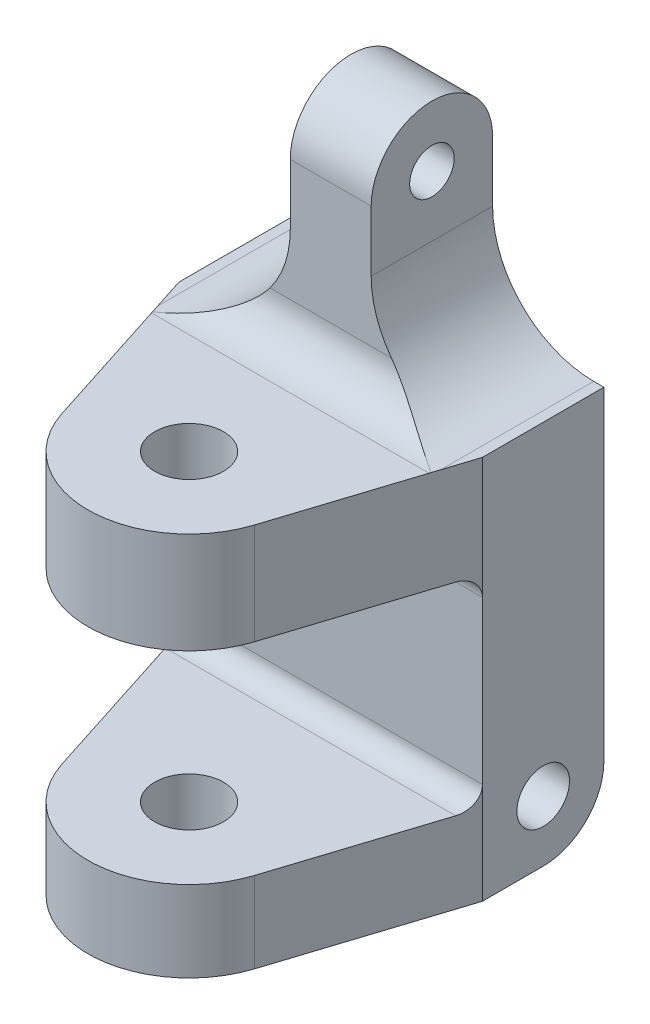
ISO-10303-21;
HEADER;
FILE_DESCRIPTION(('STEP AP214'),'2;1');
FILE_NAME('part.step','',(''),(''),'','','');
FILE_SCHEMA(('AUTOMOTIVE_DESIGN { 1 0 10303 214 1 1 1 1 }'));
ENDSEC;
DATA;
#1=APPLICATION_CONTEXT('core data for automotive mechanical design processes');
#2=APPLICATION_PROTOCOL_DEFINITION('international standard','automotive_design',2000,#1);
#3=PRODUCT_CONTEXT('',#1,'mechanical');
#4=PRODUCT('Part','Part','',(#3));
#5=PRODUCT_RELATED_PRODUCT_CATEGORY('part','',(#4));
#6=PRODUCT_DEFINITION_FORMATION('','',#4);
#7=PRODUCT_DEFINITION_CONTEXT('part definition',#1,'design');
#8=PRODUCT_DEFINITION('design','',#6,#7);
#9=PRODUCT_DEFINITION_SHAPE('','',#8);
#10=(LENGTH_UNIT() NAMED_UNIT(*) SI_UNIT(.MILLI.,.METRE.));
#11=(NAMED_UNIT(*) PLANE_ANGLE_UNIT() SI_UNIT($,.RADIAN.));
#12=(NAMED_UNIT(*) SI_UNIT($,.STERADIAN.) SOLID_ANGLE_UNIT());
#13=UNCERTAINTY_MEASURE_WITH_UNIT(LENGTH_MEASURE(1.E-05),#10,'distance_accuracy_value','');
#14=(GEOMETRIC_REPRESENTATION_CONTEXT(3) GLOBAL_UNCERTAINTY_ASSIGNED_CONTEXT((#13)) GLOBAL_UNIT_ASSIGNED_CONTEXT((#10,
#11,#12)) REPRESENTATION_CONTEXT('',''));
#15=CARTESIAN_POINT('',(0.,0.,0.));
#16=DIRECTION('',(0.,0.,1.));
#17=DIRECTION('',(1.,0.,0.));
#18=AXIS2_PLACEMENT_3D('',#15,#16,#17);
#19=CARTESIAN_POINT('',(9.525,-19.05,3.81000000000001));
#20=DIRECTION('',(0.952091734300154,0.,0.305812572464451));
#21=DIRECTION('',(0.305812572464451,0.,-0.952091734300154));
#22=AXIS2_PLACEMENT_3D('',#19,#20,#21);
#23=PLANE('',#22);
#24=DIRECTION('',(0.305812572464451,0.,-0.952091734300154));
#25=VECTOR('',#24,1.);
#26=CARTESIAN_POINT('',(9.525,5.08,3.81));
#27=LINE('',#26,#25);
#28=CARTESIAN_POINT('',(8.89,5.08,5.78695682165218));
#29=VERTEX_POINT('',#28);
#30=CARTESIAN_POINT('',(9.525,5.08,3.81000000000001));
#31=VERTEX_POINT('',#30);
#32=EDGE_CURVE('E243',#29,#31,#27,.T.);
#33=ORIENTED_EDGE('',*,*,#32,.F.);
#34=CARTESIAN_POINT('',(8.89,11.43,5.78695682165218));
#35=DIRECTION('',(0.952091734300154,0.,0.305812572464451));
#36=DIRECTION('',(-0.305812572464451,0.,0.952091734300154));
#37=AXIS2_PLACEMENT_3D('',#34,#35,#36);
#38=ELLIPSE('',#37,20.7643523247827,6.35);
#39=CARTESIAN_POINT('',(8.73968306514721,5.08177939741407,6.25494121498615));
#40=VERTEX_POINT('',#39);
#41=EDGE_CURVE('E236',#40,#29,#38,.T.);
#42=ORIENTED_EDGE('',*,*,#41,.F.);
#43=CARTESIAN_POINT('',(8.70915011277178,7.62,6.35000000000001));
#44=DIRECTION('',(0.952091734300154,0.,0.305812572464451));
#45=DIRECTION('',(0.305812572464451,0.,-0.952091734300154));
#46=AXIS2_PLACEMENT_3D('',#43,#44,#45);
#47=ELLIPSE('',#46,2.66781015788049,2.54);
#48=CARTESIAN_POINT('',(8.70915011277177,5.08,6.35000000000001));
#49=VERTEX_POINT('',#48);
#50=EDGE_CURVE('E289',#49,#40,#47,.T.);
#51=ORIENTED_EDGE('',*,*,#50,.F.);
#52=DIRECTION('',(0.305812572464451,0.,-0.952091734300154));
#53=VECTOR('',#52,1.);
#54=CARTESIAN_POINT('',(9.525,5.08,3.81000000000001));
#55=LINE('',#54,#53);
#56=CARTESIAN_POINT('',(6.04578251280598,5.08,14.6419098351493));
#57=VERTEX_POINT('',#56);
#58=EDGE_CURVE('E287',#57,#49,#55,.T.);
#59=ORIENTED_EDGE('',*,*,#58,.F.);
#60=DIRECTION('',(0.,1.,0.));
#61=VECTOR('',#60,1.);
#62=CARTESIAN_POINT('',(6.04578251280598,-19.05,14.6419098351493));
#63=LINE('',#62,#61);
#64=CARTESIAN_POINT('',(6.04578251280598,-1.27,14.6419098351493));
#65=VERTEX_POINT('',#64);
#66=EDGE_CURVE('E325',#65,#57,#63,.T.);
#67=ORIENTED_EDGE('',*,*,#66,.F.);
#68=DIRECTION('',(-0.305812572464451,0.,0.952091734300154));
#69=VECTOR('',#68,1.);
#70=CARTESIAN_POINT('',(9.525,-1.27,3.81000000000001));
#71=LINE('',#70,#69);
#72=CARTESIAN_POINT('',(9.11707505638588,-1.27,5.08));
#73=VERTEX_POINT('',#72);
#74=EDGE_CURVE('E302',#73,#65,#71,.T.);
#75=ORIENTED_EDGE('',*,*,#74,.F.);
#76=CARTESIAN_POINT('',(9.11707505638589,-2.54,5.08));
#77=DIRECTION('',(0.952091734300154,0.,0.305812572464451));
#78=DIRECTION('',(0.305812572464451,0.,-0.952091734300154));
#79=AXIS2_PLACEMENT_3D('',#76,#77,#78);
#80=ELLIPSE('',#79,1.33390507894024,1.27);
#81=CARTESIAN_POINT('',(9.525,-2.54,3.81000000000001));
#82=VERTEX_POINT('',#81);
#83=EDGE_CURVE('E298',#82,#73,#80,.T.);
#84=ORIENTED_EDGE('',*,*,#83,.F.);
#85=DIRECTION('',(0.,-1.,0.));
#86=VECTOR('',#85,1.);
#87=CARTESIAN_POINT('',(9.525,15.24,3.81000000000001));
#88=LINE('',#87,#86);
#89=EDGE_CURVE('E329',#31,#82,#88,.T.);
#90=ORIENTED_EDGE('',*,*,#89,.F.);
#91=EDGE_LOOP('',(#33,#42,#51,#59,#67,#75,#84,#90));
#92=FACE_BOUND('',#91,.T.);
#93=ADVANCED_FACE('F33',(#92),#23,.T.);
#94=CARTESIAN_POINT('',(0.,-19.05,12.7));
#95=DIRECTION('',(0.,1.,0.));
#96=DIRECTION('',(0.,0.,1.));
#97=AXIS2_PLACEMENT_3D('',#94,#95,#96);
#98=CYLINDRICAL_SURFACE('',#97,6.35);
#99=CARTESIAN_POINT('',(0.,-1.27,12.7));
#100=DIRECTION('',(0.,1.,0.));
#101=DIRECTION('',(0.,0.,1.));
#102=AXIS2_PLACEMENT_3D('',#99,#100,#101);
#103=CIRCLE('',#102,6.35);
#104=CARTESIAN_POINT('',(-6.04578251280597,-1.27,14.6419098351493));
#105=VERTEX_POINT('',#104);
#106=EDGE_CURVE('E300',#65,#105,#103,.F.);
#107=ORIENTED_EDGE('',*,*,#106,.F.);
#108=ORIENTED_EDGE('',*,*,#66,.T.);
#109=CARTESIAN_POINT('',(0.,5.08,12.7));
#110=DIRECTION('',(0.,-1.,0.));
#111=DIRECTION('',(0.,0.,-1.));
#112=AXIS2_PLACEMENT_3D('',#109,#110,#111);
#113=CIRCLE('',#112,6.35);
#114=CARTESIAN_POINT('',(-6.04578251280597,5.08,14.6419098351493));
#115=VERTEX_POINT('',#114);
#116=EDGE_CURVE('E273',#115,#57,#113,.F.);
#117=ORIENTED_EDGE('',*,*,#116,.F.);
#118=DIRECTION('',(0.,1.,0.));
#119=VECTOR('',#118,1.);
#120=CARTESIAN_POINT('',(-6.04578251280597,-19.05,14.6419098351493));
#121=LINE('',#120,#119);
#122=EDGE_CURVE('E320',#105,#115,#121,.T.);
#123=ORIENTED_EDGE('',*,*,#122,.F.);
#124=EDGE_LOOP('',(#107,#108,#117,#123));
#125=FACE_BOUND('',#124,.T.);
#126=ADVANCED_FACE('F413',(#125),#98,.T.);
#127=CARTESIAN_POINT('',(-9.525,-19.05,3.81000000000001));
#128=DIRECTION('',(-0.952091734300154,0.,0.305812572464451));
#129=DIRECTION('',(0.305812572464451,0.,0.952091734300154));
#130=AXIS2_PLACEMENT_3D('',#127,#128,#129);
#131=PLANE('',#130);
#132=CARTESIAN_POINT('',(-8.89,11.43,5.78695682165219));
#133=DIRECTION('',(-0.952091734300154,0.,0.305812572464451));
#134=DIRECTION('',(0.305812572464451,0.,0.952091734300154));
#135=AXIS2_PLACEMENT_3D('',#132,#133,#134);
#136=ELLIPSE('',#135,20.7643523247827,6.35);
#137=CARTESIAN_POINT('',(-8.89,5.08,5.78695682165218));
#138=VERTEX_POINT('',#137);
#139=CARTESIAN_POINT('',(-8.73968306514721,5.08177939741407,6.25494121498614));
#140=VERTEX_POINT('',#139);
#141=EDGE_CURVE('E48',#138,#140,#136,.T.);
#142=ORIENTED_EDGE('',*,*,#141,.F.);
#143=DIRECTION('',(0.305812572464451,0.,0.952091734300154));
#144=VECTOR('',#143,1.);
#145=CARTESIAN_POINT('',(-9.525,5.08,3.81));
#146=LINE('',#145,#144);
#147=CARTESIAN_POINT('',(-9.525,5.08,3.81000000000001));
#148=VERTEX_POINT('',#147);
#149=EDGE_CURVE('E188',#148,#138,#146,.T.);
#150=ORIENTED_EDGE('',*,*,#149,.F.);
#151=DIRECTION('',(0.,-1.,0.));
#152=VECTOR('',#151,1.);
#153=CARTESIAN_POINT('',(-9.525,15.24,3.81000000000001));
#154=LINE('',#153,#152);
#155=CARTESIAN_POINT('',(-9.525,-2.53999999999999,3.81));
#156=VERTEX_POINT('',#155);
#157=EDGE_CURVE('E338',#148,#156,#154,.T.);
#158=ORIENTED_EDGE('',*,*,#157,.T.);
#159=CARTESIAN_POINT('',(-9.11707505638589,-2.54,5.08));
#160=DIRECTION('',(-0.952091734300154,0.,0.305812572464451));
#161=DIRECTION('',(0.305812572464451,0.,0.952091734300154));
#162=AXIS2_PLACEMENT_3D('',#159,#160,#161);
#163=ELLIPSE('',#162,1.33390507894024,1.27);
#164=CARTESIAN_POINT('',(-9.11707505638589,-1.27,5.08));
#165=VERTEX_POINT('',#164);
#166=EDGE_CURVE('E358',#165,#156,#163,.T.);
#167=ORIENTED_EDGE('',*,*,#166,.F.);
#168=DIRECTION('',(-0.305812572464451,0.,-0.952091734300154));
#169=VECTOR('',#168,1.);
#170=CARTESIAN_POINT('',(-9.525,-1.27,3.81000000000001));
#171=LINE('',#170,#169);
#172=EDGE_CURVE('E361',#105,#165,#171,.T.);
#173=ORIENTED_EDGE('',*,*,#172,.F.);
#174=ORIENTED_EDGE('',*,*,#122,.T.);
#175=DIRECTION('',(0.305812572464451,0.,0.952091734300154));
#176=VECTOR('',#175,1.);
#177=CARTESIAN_POINT('',(-9.525,5.08,3.81000000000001));
#178=LINE('',#177,#176);
#179=CARTESIAN_POINT('',(-8.70915011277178,5.08,6.35000000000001));
#180=VERTEX_POINT('',#179);
#181=EDGE_CURVE('E350',#180,#115,#178,.T.);
#182=ORIENTED_EDGE('',*,*,#181,.F.);
#183=CARTESIAN_POINT('',(-8.70915011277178,7.62,6.35000000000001));
#184=DIRECTION('',(-0.952091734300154,0.,0.305812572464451));
#185=DIRECTION('',(0.305812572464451,0.,0.952091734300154));
#186=AXIS2_PLACEMENT_3D('',#183,#184,#185);
#187=ELLIPSE('',#186,2.66781015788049,2.54);
#188=EDGE_CURVE('E352',#140,#180,#187,.T.);
#189=ORIENTED_EDGE('',*,*,#188,.F.);
#190=EDGE_LOOP('',(#142,#150,#158,#167,#173,#174,#182,#189));
#191=FACE_BOUND('',#190,.T.);
#192=ADVANCED_FACE('F417',(#191),#131,.T.);
#193=CARTESIAN_POINT('',(9.525,15.24,0.));
#194=DIRECTION('',(-1.,0.,0.));
#195=DIRECTION('',(0.,0.,1.));
#196=AXIS2_PLACEMENT_3D('',#193,#194,#195);
#197=CYLINDRICAL_SURFACE('',#196,3.81);
#198=CARTESIAN_POINT('',(-2.54,15.24,0.));
#199=DIRECTION('',(1.,0.,0.));
#200=DIRECTION('',(0.,1.,0.));
#201=AXIS2_PLACEMENT_3D('',#198,#199,#200);
#202=CIRCLE('',#201,3.81);
#203=CARTESIAN_POINT('',(-2.54,15.24,-3.81));
#204=VERTEX_POINT('',#203);
#205=CARTESIAN_POINT('',(-2.54,15.24,3.81000000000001));
#206=VERTEX_POINT('',#205);
#207=EDGE_CURVE('E233',#204,#206,#202,.T.);
#208=ORIENTED_EDGE('',*,*,#207,.T.);
#209=DIRECTION('',(-1.,0.,0.));
#210=VECTOR('',#209,1.);
#211=CARTESIAN_POINT('',(9.525,15.24,3.81000000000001));
#212=LINE('',#211,#210);
#213=CARTESIAN_POINT('',(2.54000000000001,15.24,3.81000000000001));
#214=VERTEX_POINT('',#213);
#215=EDGE_CURVE('E347',#214,#206,#212,.T.);
#216=ORIENTED_EDGE('',*,*,#215,.F.);
#217=CARTESIAN_POINT('',(2.54000000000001,15.24,0.));
#218=DIRECTION('',(-1.,0.,0.));
#219=DIRECTION('',(0.,-1.,0.));
#220=AXIS2_PLACEMENT_3D('',#217,#218,#219);
#221=CIRCLE('',#220,3.81);
#222=CARTESIAN_POINT('',(2.54000000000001,15.24,-3.81));
#223=VERTEX_POINT('',#222);
#224=EDGE_CURVE('E227',#214,#223,#221,.T.);
#225=ORIENTED_EDGE('',*,*,#224,.T.);
#226=DIRECTION('',(-1.,0.,0.));
#227=VECTOR('',#226,1.);
#228=CARTESIAN_POINT('',(9.525,15.24,-3.80999999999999));
#229=LINE('',#228,#227);
#230=EDGE_CURVE('E337',#223,#204,#229,.T.);
#231=ORIENTED_EDGE('',*,*,#230,.T.);
#232=EDGE_LOOP('',(#208,#216,#225,#231));
#233=FACE_BOUND('',#232,.T.);
#234=ADVANCED_FACE('F35',(#233),#197,.T.);
#235=CARTESIAN_POINT('',(9.525,-15.24,0.));
#236=DIRECTION('',(-1.,0.,0.));
#237=DIRECTION('',(0.,0.,1.));
#238=AXIS2_PLACEMENT_3D('',#235,#236,#237);
#239=CYLINDRICAL_SURFACE('',#238,3.81);
#240=CARTESIAN_POINT('',(9.525,-15.24,0.));
#241=DIRECTION('',(1.,0.,0.));
#242=DIRECTION('',(0.,0.,-1.));
#243=AXIS2_PLACEMENT_3D('',#240,#241,#242);
#244=CIRCLE('',#243,3.81);
#245=CARTESIAN_POINT('',(9.525,-19.05,0.));
#246=VERTEX_POINT('',#245);
#247=CARTESIAN_POINT('',(9.525,-15.24,-3.81));
#248=VERTEX_POINT('',#247);
#249=EDGE_CURVE('E331',#246,#248,#244,.T.);
#250=ORIENTED_EDGE('',*,*,#249,.F.);
#251=DIRECTION('',(-1.,0.,0.));
#252=VECTOR('',#251,1.);
#253=CARTESIAN_POINT('',(-9.525,-19.05,0.));
#254=LINE('',#253,#252);
#255=CARTESIAN_POINT('',(-9.525,-19.05,0.));
#256=VERTEX_POINT('',#255);
#257=EDGE_CURVE('E307',#246,#256,#254,.T.);
#258=ORIENTED_EDGE('',*,*,#257,.T.);
#259=CARTESIAN_POINT('',(-9.525,-15.24,0.));
#260=DIRECTION('',(1.,0.,0.));
#261=DIRECTION('',(0.,0.,-1.));
#262=AXIS2_PLACEMENT_3D('',#259,#260,#261);
#263=CIRCLE('',#262,3.81);
#264=CARTESIAN_POINT('',(-9.525,-15.24,-3.81));
#265=VERTEX_POINT('',#264);
#266=EDGE_CURVE('E340',#256,#265,#263,.T.);
#267=ORIENTED_EDGE('',*,*,#266,.T.);
#268=DIRECTION('',(-1.,0.,0.));
#269=VECTOR('',#268,1.);
#270=CARTESIAN_POINT('',(9.525,-15.24,-3.81));
#271=LINE('',#270,#269);
#272=EDGE_CURVE('E345',#248,#265,#271,.T.);
#273=ORIENTED_EDGE('',*,*,#272,.F.);
#274=EDGE_LOOP('',(#250,#258,#267,#273));
#275=FACE_BOUND('',#274,.T.);
#276=ADVANCED_FACE('F426',(#275),#239,.T.);
#277=CARTESIAN_POINT('',(9.525,15.24,-3.80999999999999));
#278=DIRECTION('',(0.,0.,1.));
#279=DIRECTION('',(0.,-1.,0.));
#280=AXIS2_PLACEMENT_3D('',#277,#278,#279);
#281=PLANE('',#280);
#282=CARTESIAN_POINT('',(-8.89,11.43,-3.81));
#283=DIRECTION('',(0.,0.,1.));
#284=DIRECTION('',(-1.,0.,0.));
#285=AXIS2_PLACEMENT_3D('',#282,#283,#284);
#286=CIRCLE('',#285,6.35);
#287=CARTESIAN_POINT('',(-8.89,5.08,-3.81));
#288=VERTEX_POINT('',#287);
#289=CARTESIAN_POINT('',(-2.54,11.43,-3.81));
#290=VERTEX_POINT('',#289);
#291=EDGE_CURVE('E193',#288,#290,#286,.T.);
#292=ORIENTED_EDGE('',*,*,#291,.T.);
#293=DIRECTION('',(0.,1.,0.));
#294=VECTOR('',#293,1.);
#295=CARTESIAN_POINT('',(-2.54,19.05,-3.81));
#296=LINE('',#295,#294);
#297=EDGE_CURVE('E190',#290,#204,#296,.T.);
#298=ORIENTED_EDGE('',*,*,#297,.T.);
#299=ORIENTED_EDGE('',*,*,#230,.F.);
#300=DIRECTION('',(0.,-1.,0.));
#301=VECTOR('',#300,1.);
#302=CARTESIAN_POINT('',(2.54000000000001,19.05,-3.81));
#303=LINE('',#302,#301);
#304=CARTESIAN_POINT('',(2.54000000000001,11.43,-3.81));
#305=VERTEX_POINT('',#304);
#306=EDGE_CURVE('E214',#223,#305,#303,.T.);
#307=ORIENTED_EDGE('',*,*,#306,.T.);
#308=CARTESIAN_POINT('',(8.89,11.43,-3.81));
#309=DIRECTION('',(0.,0.,1.));
#310=DIRECTION('',(1.,0.,0.));
#311=AXIS2_PLACEMENT_3D('',#308,#309,#310);
#312=CIRCLE('',#311,6.35);
#313=CARTESIAN_POINT('',(8.89,5.08,-3.81));
#314=VERTEX_POINT('',#313);
#315=EDGE_CURVE('E217',#305,#314,#312,.T.);
#316=ORIENTED_EDGE('',*,*,#315,.T.);
#317=DIRECTION('',(1.,0.,0.));
#318=VECTOR('',#317,1.);
#319=CARTESIAN_POINT('',(8.89,5.08,-3.81));
#320=LINE('',#319,#318);
#321=CARTESIAN_POINT('',(9.525,5.08,-3.81));
#322=VERTEX_POINT('',#321);
#323=EDGE_CURVE('E220',#314,#322,#320,.T.);
#324=ORIENTED_EDGE('',*,*,#323,.T.);
#325=DIRECTION('',(0.,1.,0.));
#326=VECTOR('',#325,1.);
#327=CARTESIAN_POINT('',(9.525,15.24,-3.80999999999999));
#328=LINE('',#327,#326);
#329=EDGE_CURVE('E334',#248,#322,#328,.T.);
#330=ORIENTED_EDGE('',*,*,#329,.F.);
#331=ORIENTED_EDGE('',*,*,#272,.T.);
#332=DIRECTION('',(0.,1.,0.));
#333=VECTOR('',#332,1.);
#334=CARTESIAN_POINT('',(-9.525,15.24,-3.80999999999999));
#335=LINE('',#334,#333);
#336=CARTESIAN_POINT('',(-9.525,5.08,-3.81));
#337=VERTEX_POINT('',#336);
#338=EDGE_CURVE('E204',#265,#337,#335,.T.);
#339=ORIENTED_EDGE('',*,*,#338,.T.);
#340=DIRECTION('',(1.,0.,0.));
#341=VECTOR('',#340,1.);
#342=CARTESIAN_POINT('',(-8.89,5.08,-3.81));
#343=LINE('',#342,#341);
#344=EDGE_CURVE('E185',#337,#288,#343,.T.);
#345=ORIENTED_EDGE('',*,*,#344,.T.);
#346=EDGE_LOOP('',(#292,#298,#299,#307,#316,#324,#330,#331,#339,#345));
#347=FACE_BOUND('',#346,.T.);
#348=ADVANCED_FACE('F201',(#347),#281,.F.);
#349=CARTESIAN_POINT('',(9.525,15.24,0.));
#350=DIRECTION('',(1.,0.,0.));
#351=DIRECTION('',(0.,0.,-1.));
#352=AXIS2_PLACEMENT_3D('',#349,#350,#351);
#353=PLANE('',#352);
#354=DIRECTION('',(0.,0.,-1.));
#355=VECTOR('',#354,1.);
#356=CARTESIAN_POINT('',(9.525,5.08,0.));
#357=LINE('',#356,#355);
#358=EDGE_CURVE('E11',#31,#322,#357,.T.);
#359=ORIENTED_EDGE('',*,*,#358,.F.);
#360=ORIENTED_EDGE('',*,*,#89,.T.);
#361=DIRECTION('',(0.,1.,0.));
#362=VECTOR('',#361,1.);
#363=CARTESIAN_POINT('',(9.525,-12.7,3.81000000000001));
#364=LINE('',#363,#362);
#365=CARTESIAN_POINT('',(9.525,-12.7,3.81));
#366=VERTEX_POINT('',#365);
#367=EDGE_CURVE('E262',#366,#82,#364,.T.);
#368=ORIENTED_EDGE('',*,*,#367,.F.);
#369=CARTESIAN_POINT('',(9.525,-19.05,3.81000000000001));
#370=VERTEX_POINT('',#369);
#371=EDGE_CURVE('E332',#366,#370,#88,.T.);
#372=ORIENTED_EDGE('',*,*,#371,.T.);
#373=DIRECTION('',(0.,0.,-1.));
#374=VECTOR('',#373,1.);
#375=CARTESIAN_POINT('',(9.525,-19.05,0.));
#376=LINE('',#375,#374);
#377=EDGE_CURVE('E304',#370,#246,#376,.T.);
#378=ORIENTED_EDGE('',*,*,#377,.T.);
#379=ORIENTED_EDGE('',*,*,#249,.T.);
#380=ORIENTED_EDGE('',*,*,#329,.T.);
#381=EDGE_LOOP('',(#359,#360,#368,#372,#378,#379,#380));
#382=FACE_BOUND('',#381,.T.);
#383=CARTESIAN_POINT('',(9.525,-15.24,0.));
#384=DIRECTION('',(-1.,0.,0.));
#385=DIRECTION('',(0.,0.,1.));
#386=AXIS2_PLACEMENT_3D('',#383,#384,#385);
#387=CIRCLE('',#386,1.651);
#388=CARTESIAN_POINT('',(9.525,-15.24,1.651));
#389=VERTEX_POINT('',#388);
#390=EDGE_CURVE('E256',#389,#389,#387,.T.);
#391=ORIENTED_EDGE('',*,*,#390,.T.);
#392=EDGE_LOOP('',(#391));
#393=FACE_BOUND('',#392,.T.);
#394=ADVANCED_FACE('F418',(#382,#393),#353,.T.);
#395=CARTESIAN_POINT('',(-9.525,15.24,0.));
#396=DIRECTION('',(1.,0.,0.));
#397=DIRECTION('',(0.,0.,-1.));
#398=AXIS2_PLACEMENT_3D('',#395,#396,#397);
#399=PLANE('',#398);
#400=CARTESIAN_POINT('',(-9.525,-15.24,0.));
#401=DIRECTION('',(-1.,0.,0.));
#402=DIRECTION('',(0.,0.,1.));
#403=AXIS2_PLACEMENT_3D('',#400,#401,#402);
#404=CIRCLE('',#403,1.651);
#405=CARTESIAN_POINT('',(-9.525,-15.24,1.651));
#406=VERTEX_POINT('',#405);
#407=EDGE_CURVE('E255',#406,#406,#404,.T.);
#408=ORIENTED_EDGE('',*,*,#407,.F.);
#409=EDGE_LOOP('',(#408));
#410=FACE_BOUND('',#409,.T.);
#411=ORIENTED_EDGE('',*,*,#157,.F.);
#412=DIRECTION('',(0.,0.,-1.));
#413=VECTOR('',#412,1.);
#414=CARTESIAN_POINT('',(-9.525,5.08,0.));
#415=LINE('',#414,#413);
#416=EDGE_CURVE('E41',#148,#337,#415,.T.);
#417=ORIENTED_EDGE('',*,*,#416,.T.);
#418=ORIENTED_EDGE('',*,*,#338,.F.);
#419=ORIENTED_EDGE('',*,*,#266,.F.);
#420=DIRECTION('',(0.,0.,1.));
#421=VECTOR('',#420,1.);
#422=CARTESIAN_POINT('',(-9.525,-19.05,3.81000000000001));
#423=LINE('',#422,#421);
#424=CARTESIAN_POINT('',(-9.525,-19.05,3.81000000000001));
#425=VERTEX_POINT('',#424);
#426=EDGE_CURVE('E309',#256,#425,#423,.T.);
#427=ORIENTED_EDGE('',*,*,#426,.T.);
#428=CARTESIAN_POINT('',(-9.525,-12.7,3.81));
#429=VERTEX_POINT('',#428);
#430=EDGE_CURVE('E324',#429,#425,#154,.T.);
#431=ORIENTED_EDGE('',*,*,#430,.F.);
#432=DIRECTION('',(0.,1.,0.));
#433=VECTOR('',#432,1.);
#434=CARTESIAN_POINT('',(-9.525,-12.7,3.81000000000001));
#435=LINE('',#434,#433);
#436=EDGE_CURVE('E265',#429,#156,#435,.T.);
#437=ORIENTED_EDGE('',*,*,#436,.T.);
#438=EDGE_LOOP('',(#411,#417,#418,#419,#427,#431,#437));
#439=FACE_BOUND('',#438,.T.);
#440=ADVANCED_FACE('F408',(#410,#439),#399,.F.);
#441=CARTESIAN_POINT('',(9.11707505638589,-12.7,5.08));
#442=DIRECTION('',(0.952091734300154,0.,0.305812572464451));
#443=DIRECTION('',(0.305812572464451,0.,-0.952091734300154));
#444=AXIS2_PLACEMENT_3D('',#441,#442,#443);
#445=ELLIPSE('',#444,1.33390507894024,1.27);
#446=CARTESIAN_POINT('',(9.11707505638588,-13.97,5.08));
#447=VERTEX_POINT('',#446);
#448=EDGE_CURVE('E296',#447,#366,#445,.T.);
#449=ORIENTED_EDGE('',*,*,#448,.F.);
#450=DIRECTION('',(0.305812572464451,0.,-0.952091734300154));
#451=VECTOR('',#450,1.);
#452=CARTESIAN_POINT('',(9.525,-13.97,3.81));
#453=LINE('',#452,#451);
#454=CARTESIAN_POINT('',(6.04578251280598,-13.97,14.6419098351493));
#455=VERTEX_POINT('',#454);
#456=EDGE_CURVE('E294',#455,#447,#453,.T.);
#457=ORIENTED_EDGE('',*,*,#456,.F.);
#458=CARTESIAN_POINT('',(6.04578251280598,-19.05,14.6419098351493));
#459=VERTEX_POINT('',#458);
#460=EDGE_CURVE('E321',#459,#455,#63,.T.);
#461=ORIENTED_EDGE('',*,*,#460,.F.);
#462=DIRECTION('',(0.305812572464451,0.,-0.952091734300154));
#463=VECTOR('',#462,1.);
#464=CARTESIAN_POINT('',(9.525,-19.05,3.81000000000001));
#465=LINE('',#464,#463);
#466=EDGE_CURVE('E317',#459,#370,#465,.T.);
#467=ORIENTED_EDGE('',*,*,#466,.T.);
#468=ORIENTED_EDGE('',*,*,#371,.F.);
#469=EDGE_LOOP('',(#449,#457,#461,#467,#468));
#470=FACE_BOUND('',#469,.T.);
#471=ADVANCED_FACE('F404',(#470),#23,.T.);
#472=CARTESIAN_POINT('',(0.,-13.97,12.7));
#473=DIRECTION('',(0.,-1.,0.));
#474=DIRECTION('',(0.,0.,-1.));
#475=AXIS2_PLACEMENT_3D('',#472,#473,#474);
#476=CIRCLE('',#475,6.35);
#477=CARTESIAN_POINT('',(-6.04578251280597,-13.97,14.6419098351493));
#478=VERTEX_POINT('',#477);
#479=EDGE_CURVE('E292',#478,#455,#476,.F.);
#480=ORIENTED_EDGE('',*,*,#479,.F.);
#481=CARTESIAN_POINT('',(-6.04578251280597,-19.05,14.6419098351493));
#482=VERTEX_POINT('',#481);
#483=EDGE_CURVE('E326',#482,#478,#121,.T.);
#484=ORIENTED_EDGE('',*,*,#483,.F.);
#485=CARTESIAN_POINT('',(0.,-19.05,12.7));
#486=DIRECTION('',(0.,1.,0.));
#487=DIRECTION('',(0.,0.,1.));
#488=AXIS2_PLACEMENT_3D('',#485,#486,#487);
#489=CIRCLE('',#488,6.35);
#490=EDGE_CURVE('E315',#482,#459,#489,.T.);
#491=ORIENTED_EDGE('',*,*,#490,.T.);
#492=ORIENTED_EDGE('',*,*,#460,.T.);
#493=EDGE_LOOP('',(#480,#484,#491,#492));
#494=FACE_BOUND('',#493,.T.);
#495=ADVANCED_FACE('F407',(#494),#98,.T.);
#496=CARTESIAN_POINT('',(-9.11707505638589,-12.7,5.08));
#497=DIRECTION('',(-0.952091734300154,0.,0.305812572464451));
#498=DIRECTION('',(0.305812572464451,0.,0.952091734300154));
#499=AXIS2_PLACEMENT_3D('',#496,#497,#498);
#500=ELLIPSE('',#499,1.33390507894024,1.27);
#501=CARTESIAN_POINT('',(-9.11707505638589,-13.97,5.08));
#502=VERTEX_POINT('',#501);
#503=EDGE_CURVE('E356',#429,#502,#500,.T.);
#504=ORIENTED_EDGE('',*,*,#503,.F.);
#505=ORIENTED_EDGE('',*,*,#430,.T.);
#506=DIRECTION('',(0.305812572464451,0.,0.952091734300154));
#507=VECTOR('',#506,1.);
#508=CARTESIAN_POINT('',(-9.525,-19.05,3.81000000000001));
#509=LINE('',#508,#507);
#510=EDGE_CURVE('E312',#425,#482,#509,.T.);
#511=ORIENTED_EDGE('',*,*,#510,.T.);
#512=ORIENTED_EDGE('',*,*,#483,.T.);
#513=DIRECTION('',(0.305812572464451,0.,0.952091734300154));
#514=VECTOR('',#513,1.);
#515=CARTESIAN_POINT('',(-9.525,-13.97,3.81));
#516=LINE('',#515,#514);
#517=EDGE_CURVE('E354',#502,#478,#516,.T.);
#518=ORIENTED_EDGE('',*,*,#517,.F.);
#519=EDGE_LOOP('',(#504,#505,#511,#512,#518));
#520=FACE_BOUND('',#519,.T.);
#521=ADVANCED_FACE('F402',(#520),#131,.T.);
#522=CARTESIAN_POINT('',(0.,-19.05,12.7));
#523=DIRECTION('',(0.,-1.,0.));
#524=DIRECTION('',(0.,0.,-1.));
#525=AXIS2_PLACEMENT_3D('',#522,#523,#524);
#526=PLANE('',#525);
#527=CARTESIAN_POINT('',(0.,-19.05,12.7));
#528=DIRECTION('',(0.,1.,0.));
#529=DIRECTION('',(0.,0.,1.));
#530=AXIS2_PLACEMENT_3D('',#527,#528,#529);
#531=CIRCLE('',#530,2.159);
#532=CARTESIAN_POINT('',(0.,-19.05,14.859));
#533=VERTEX_POINT('',#532);
#534=EDGE_CURVE('E246',#533,#533,#531,.T.);
#535=ORIENTED_EDGE('',*,*,#534,.T.);
#536=EDGE_LOOP('',(#535));
#537=FACE_BOUND('',#536,.T.);
#538=ORIENTED_EDGE('',*,*,#377,.F.);
#539=ORIENTED_EDGE('',*,*,#466,.F.);
#540=ORIENTED_EDGE('',*,*,#490,.F.);
#541=ORIENTED_EDGE('',*,*,#510,.F.);
#542=ORIENTED_EDGE('',*,*,#426,.F.);
#543=ORIENTED_EDGE('',*,*,#257,.F.);
#544=EDGE_LOOP('',(#538,#539,#540,#541,#542,#543));
#545=FACE_BOUND('',#544,.T.);
#546=ADVANCED_FACE('F399',(#537,#545),#526,.T.);
#547=CARTESIAN_POINT('',(-9.525,7.62,3.81000000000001));
#548=DIRECTION('',(0.,0.,-1.));
#549=DIRECTION('',(0.,1.,0.));
#550=AXIS2_PLACEMENT_3D('',#547,#548,#549);
#551=PLANE('',#550);
#552=ORIENTED_EDGE('',*,*,#215,.T.);
#553=DIRECTION('',(0.,-1.,0.));
#554=VECTOR('',#553,1.);
#555=CARTESIAN_POINT('',(-2.54,7.62,3.81000000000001));
#556=LINE('',#555,#554);
#557=CARTESIAN_POINT('',(-2.54,11.43,3.81000000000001));
#558=VERTEX_POINT('',#557);
#559=EDGE_CURVE('E230',#206,#558,#556,.T.);
#560=ORIENTED_EDGE('',*,*,#559,.T.);
#561=CARTESIAN_POINT('',(-8.89,11.43,3.81000000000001));
#562=DIRECTION('',(0.,0.,-1.));
#563=DIRECTION('',(0.,1.,0.));
#564=AXIS2_PLACEMENT_3D('',#561,#562,#563);
#565=CIRCLE('',#564,6.35);
#566=CARTESIAN_POINT('',(-3.81,7.62,3.81000000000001));
#567=VERTEX_POINT('',#566);
#568=EDGE_CURVE('E238',#558,#567,#565,.T.);
#569=ORIENTED_EDGE('',*,*,#568,.T.);
#570=DIRECTION('',(1.,0.,0.));
#571=VECTOR('',#570,1.);
#572=CARTESIAN_POINT('',(-9.525,7.62,3.81000000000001));
#573=LINE('',#572,#571);
#574=CARTESIAN_POINT('',(3.80999999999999,7.62,3.81000000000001));
#575=VERTEX_POINT('',#574);
#576=EDGE_CURVE('E266',#567,#575,#573,.T.);
#577=ORIENTED_EDGE('',*,*,#576,.T.);
#578=CARTESIAN_POINT('',(8.89,11.43,3.81000000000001));
#579=DIRECTION('',(0.,0.,-1.));
#580=DIRECTION('',(0.,1.,0.));
#581=AXIS2_PLACEMENT_3D('',#578,#579,#580);
#582=CIRCLE('',#581,6.35);
#583=CARTESIAN_POINT('',(2.54000000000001,11.43,3.81000000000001));
#584=VERTEX_POINT('',#583);
#585=EDGE_CURVE('E56',#575,#584,#582,.T.);
#586=ORIENTED_EDGE('',*,*,#585,.T.);
#587=DIRECTION('',(0.,1.,0.));
#588=VECTOR('',#587,1.);
#589=CARTESIAN_POINT('',(2.54000000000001,7.62,3.81000000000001));
#590=LINE('',#589,#588);
#591=EDGE_CURVE('E224',#584,#214,#590,.T.);
#592=ORIENTED_EDGE('',*,*,#591,.T.);
#593=EDGE_LOOP('',(#552,#560,#569,#577,#586,#592));
#594=FACE_BOUND('',#593,.T.);
#595=ADVANCED_FACE('F391',(#594),#551,.F.);
#596=CARTESIAN_POINT('',(-9.525,7.62,6.35000000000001));
#597=DIRECTION('',(1.,0.,0.));
#598=DIRECTION('',(0.,0.,-1.));
#599=AXIS2_PLACEMENT_3D('',#596,#597,#598);
#600=CYLINDRICAL_SURFACE('',#599,2.54);
#601=ORIENTED_EDGE('',*,*,#576,.F.);
#602=CARTESIAN_POINT('',(-3.81,7.62,3.81000000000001));
#603=CARTESIAN_POINT('',(-3.87514073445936,7.5331140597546,3.81000858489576));
#604=CARTESIAN_POINT('',(-3.94248912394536,7.44798901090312,3.81445569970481));
#605=CARTESIAN_POINT('',(-4.08092560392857,7.28187912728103,3.83122283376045));
#606=CARTESIAN_POINT('',(-4.15200703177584,7.20088739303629,3.84352923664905));
#607=CARTESIAN_POINT('',(-4.29677162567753,7.04410773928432,3.87486802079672));
#608=CARTESIAN_POINT('',(-4.37042363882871,6.96827767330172,3.89383535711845));
#609=CARTESIAN_POINT('',(-4.52053104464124,6.82117254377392,3.93766329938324));
#610=CARTESIAN_POINT('',(-4.59698805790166,6.74990018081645,3.96252735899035));
#611=CARTESIAN_POINT('',(-4.78522200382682,6.58282012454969,4.02900402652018));
#612=CARTESIAN_POINT('',(-4.89822439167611,6.4894286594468,4.0732473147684));
#613=CARTESIAN_POINT('',(-5.12802471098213,6.31227391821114,4.17017264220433));
#614=CARTESIAN_POINT('',(-5.24482358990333,6.22851306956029,4.22285680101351));
#615=CARTESIAN_POINT('',(-5.60111378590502,5.99055602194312,4.3918013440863));
#616=CARTESIAN_POINT('',(-5.84536436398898,5.85067639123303,4.51852547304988));
#617=CARTESIAN_POINT('',(-6.26872367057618,5.64297411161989,4.75013203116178));
#618=CARTESIAN_POINT('',(-6.4460069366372,5.56604015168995,4.85057303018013));
#619=CARTESIAN_POINT('',(-6.80349040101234,5.42953632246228,5.05814251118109));
#620=CARTESIAN_POINT('',(-6.98369199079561,5.36997501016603,5.16527425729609));
#621=CARTESIAN_POINT('',(-7.34563351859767,5.26779746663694,5.38393475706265));
#622=CARTESIAN_POINT('',(-7.5273696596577,5.22514758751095,5.49545428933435));
#623=CARTESIAN_POINT('',(-7.89198991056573,5.15617552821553,5.72142098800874));
#624=CARTESIAN_POINT('',(-8.07487336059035,5.12984470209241,5.83586657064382));
#625=CARTESIAN_POINT('',(-8.36102595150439,5.10122466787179,6.01582790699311));
#626=CARTESIAN_POINT('',(-8.46410400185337,5.09345692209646,6.0808338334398));
#627=CARTESIAN_POINT('',(-8.67030190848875,5.08296281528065,6.21105475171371));
#628=CARTESIAN_POINT('',(-8.77342168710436,5.08023298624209,6.27626956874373));
#629=CARTESIAN_POINT('',(-8.88102032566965,5.08000476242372,6.34432075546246));
#630=CARTESIAN_POINT('',(-8.88551017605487,5.08000000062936,6.34716038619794));
#631=CARTESIAN_POINT('',(-8.89,5.08,6.35000000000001));
#632=B_SPLINE_CURVE_WITH_KNOTS('',3,(#602,#603,#604,#605,#606,#607,#608,#609,#610,#611,#612,
#613,#614,#615,#616,#617,#618,#619,#620,#621,#622,#623,#624,#625,#626,#627,#628,#629,#630,#631),
.UNSPECIFIED.,.F.,.F.,(4,2,2,2,2,2,2,2,2,2,2,2,2,2,4),(0.,0.325530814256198,0.650499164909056,
0.972378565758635,1.29444695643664,1.75312747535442,2.21192335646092,3.13415802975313,
3.78684929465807,4.43986150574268,5.09156784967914,5.74292861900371,6.10917885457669,
6.47517687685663,6.49111426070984),.UNSPECIFIED.);
#633=EDGE_CURVE('E376',#567,#140,#632,.T.);
#634=ORIENTED_EDGE('',*,*,#633,.T.);
#635=ORIENTED_EDGE('',*,*,#188,.T.);
#636=DIRECTION('',(1.,0.,0.));
#637=VECTOR('',#636,1.);
#638=CARTESIAN_POINT('',(-9.525,5.08,6.35000000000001));
#639=LINE('',#638,#637);
#640=EDGE_CURVE('E259',#180,#49,#639,.T.);
#641=ORIENTED_EDGE('',*,*,#640,.T.);
#642=ORIENTED_EDGE('',*,*,#50,.T.);
#643=CARTESIAN_POINT('',(3.81,7.62,3.81000000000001));
#644=CARTESIAN_POINT('',(3.87514073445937,7.5331140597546,3.81000858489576));
#645=CARTESIAN_POINT('',(3.94248912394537,7.44798901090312,3.81445569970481));
#646=CARTESIAN_POINT('',(4.08092560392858,7.28187912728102,3.83122283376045));
#647=CARTESIAN_POINT('',(4.15200703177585,7.20088739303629,3.84352923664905));
#648=CARTESIAN_POINT('',(4.29677162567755,7.04410773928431,3.87486802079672));
#649=CARTESIAN_POINT('',(4.37042363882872,6.96827767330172,3.89383535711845));
#650=CARTESIAN_POINT('',(4.52053104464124,6.82117254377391,3.93766329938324));
#651=CARTESIAN_POINT('',(4.59698805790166,6.74990018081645,3.96252735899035));
#652=CARTESIAN_POINT('',(4.78522200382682,6.5828201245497,4.02900402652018));
#653=CARTESIAN_POINT('',(4.89822439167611,6.48942865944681,4.07324731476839));
#654=CARTESIAN_POINT('',(5.12802471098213,6.31227391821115,4.17017264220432));
#655=CARTESIAN_POINT('',(5.24482358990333,6.22851306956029,4.22285680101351));
#656=CARTESIAN_POINT('',(5.60111378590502,5.99055602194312,4.3918013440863));
#657=CARTESIAN_POINT('',(5.84536436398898,5.85067639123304,4.51852547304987));
#658=CARTESIAN_POINT('',(6.26872367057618,5.6429741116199,4.75013203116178));
#659=CARTESIAN_POINT('',(6.4460069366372,5.56604015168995,4.85057303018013));
#660=CARTESIAN_POINT('',(6.80349040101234,5.42953632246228,5.05814251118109));
#661=CARTESIAN_POINT('',(6.98369199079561,5.36997501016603,5.1652742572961));
#662=CARTESIAN_POINT('',(7.34563351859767,5.26779746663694,5.38393475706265));
#663=CARTESIAN_POINT('',(7.52736965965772,5.22514758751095,5.49545428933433));
#664=CARTESIAN_POINT('',(7.89198991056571,5.15617552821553,5.72142098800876));
#665=CARTESIAN_POINT('',(8.07487336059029,5.12984470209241,5.83586657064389));
#666=CARTESIAN_POINT('',(8.3610259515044,5.10122466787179,6.01582790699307));
#667=CARTESIAN_POINT('',(8.46410400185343,5.09345692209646,6.08083383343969));
#668=CARTESIAN_POINT('',(8.67030190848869,5.08296281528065,6.21105475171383));
#669=CARTESIAN_POINT('',(8.77342168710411,5.08023298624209,6.27626956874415));
#670=CARTESIAN_POINT('',(8.88102032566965,5.08000476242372,6.3443207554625));
#671=CARTESIAN_POINT('',(8.88551017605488,5.08000000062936,6.34716038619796));
#672=CARTESIAN_POINT('',(8.89000000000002,5.08,6.35000000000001));
#673=B_SPLINE_CURVE_WITH_KNOTS('',3,(#643,#644,#645,#646,#647,#648,#649,#650,#651,#652,#653,
#654,#655,#656,#657,#658,#659,#660,#661,#662,#663,#664,#665,#666,#667,#668,#669,#670,#671,#672),
.UNSPECIFIED.,.F.,.F.,(4,2,2,2,2,2,2,2,2,2,2,2,2,2,4),(0.,0.325530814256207,0.650499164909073,
0.972378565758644,1.29444695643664,1.75312747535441,2.21192335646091,3.13415802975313,
3.78684929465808,4.43986150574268,5.09156784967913,5.7429286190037,6.10917885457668,
6.47517687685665,6.49111426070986),.UNSPECIFIED.);
#674=EDGE_CURVE('E363',#40,#575,#673,.F.);
#675=ORIENTED_EDGE('',*,*,#674,.T.);
#676=EDGE_LOOP('',(#601,#634,#635,#641,#642,#675));
#677=FACE_BOUND('',#676,.T.);
#678=ADVANCED_FACE('F385',(#677),#600,.F.);
#679=CARTESIAN_POINT('',(-9.525,5.08,38.1026958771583));
#680=DIRECTION('',(0.,-1.,0.));
#681=DIRECTION('',(0.,0.,-1.));
#682=AXIS2_PLACEMENT_3D('',#679,#680,#681);
#683=PLANE('',#682);
#684=CARTESIAN_POINT('',(0.,5.08,12.7));
#685=DIRECTION('',(0.,1.,0.));
#686=DIRECTION('',(0.,0.,1.));
#687=AXIS2_PLACEMENT_3D('',#684,#685,#686);
#688=CIRCLE('',#687,2.159);
#689=CARTESIAN_POINT('',(0.,5.08,14.859));
#690=VERTEX_POINT('',#689);
#691=EDGE_CURVE('E245',#690,#690,#688,.T.);
#692=ORIENTED_EDGE('',*,*,#691,.F.);
#693=EDGE_LOOP('',(#692));
#694=FACE_BOUND('',#693,.T.);
#695=ORIENTED_EDGE('',*,*,#58,.T.);
#696=ORIENTED_EDGE('',*,*,#640,.F.);
#697=ORIENTED_EDGE('',*,*,#181,.T.);
#698=ORIENTED_EDGE('',*,*,#116,.T.);
#699=EDGE_LOOP('',(#695,#696,#697,#698));
#700=FACE_BOUND('',#699,.T.);
#701=ADVANCED_FACE('F390',(#694,#700),#683,.F.);
#702=CARTESIAN_POINT('',(-9.525,-1.27,38.1026958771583));
#703=DIRECTION('',(0.,1.,0.));
#704=DIRECTION('',(0.,0.,1.));
#705=AXIS2_PLACEMENT_3D('',#702,#703,#704);
#706=PLANE('',#705);
#707=CARTESIAN_POINT('',(0.,-1.27,12.7));
#708=DIRECTION('',(0.,1.,0.));
#709=DIRECTION('',(0.,0.,1.));
#710=AXIS2_PLACEMENT_3D('',#707,#708,#709);
#711=CIRCLE('',#710,2.159);
#712=CARTESIAN_POINT('',(0.,-1.27,14.859));
#713=VERTEX_POINT('',#712);
#714=EDGE_CURVE('E252',#713,#713,#711,.T.);
#715=ORIENTED_EDGE('',*,*,#714,.T.);
#716=EDGE_LOOP('',(#715));
#717=FACE_BOUND('',#716,.T.);
#718=ORIENTED_EDGE('',*,*,#74,.T.);
#719=ORIENTED_EDGE('',*,*,#106,.T.);
#720=ORIENTED_EDGE('',*,*,#172,.T.);
#721=DIRECTION('',(1.,0.,0.));
#722=VECTOR('',#721,1.);
#723=CARTESIAN_POINT('',(-9.525,-1.27,5.08));
#724=LINE('',#723,#722);
#725=EDGE_CURVE('E270',#165,#73,#724,.T.);
#726=ORIENTED_EDGE('',*,*,#725,.T.);
#727=EDGE_LOOP('',(#718,#719,#720,#726));
#728=FACE_BOUND('',#727,.T.);
#729=ADVANCED_FACE('F397',(#717,#728),#706,.F.);
#730=CARTESIAN_POINT('',(-9.525,-2.54,5.08));
#731=DIRECTION('',(1.,0.,0.));
#732=DIRECTION('',(0.,0.,-1.));
#733=AXIS2_PLACEMENT_3D('',#730,#731,#732);
#734=CYLINDRICAL_SURFACE('',#733,1.27);
#735=ORIENTED_EDGE('',*,*,#83,.T.);
#736=ORIENTED_EDGE('',*,*,#725,.F.);
#737=ORIENTED_EDGE('',*,*,#166,.T.);
#738=DIRECTION('',(1.,0.,0.));
#739=VECTOR('',#738,1.);
#740=CARTESIAN_POINT('',(-9.525,-2.54,3.81000000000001));
#741=LINE('',#740,#739);
#742=EDGE_CURVE('E274',#156,#82,#741,.T.);
#743=ORIENTED_EDGE('',*,*,#742,.T.);
#744=EDGE_LOOP('',(#735,#736,#737,#743));
#745=FACE_BOUND('',#744,.T.);
#746=ADVANCED_FACE('F486',(#745),#734,.F.);
#747=CARTESIAN_POINT('',(-9.525,-12.7,3.81000000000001));
#748=DIRECTION('',(0.,0.,-1.));
#749=DIRECTION('',(-1.,0.,0.));
#750=AXIS2_PLACEMENT_3D('',#747,#748,#749);
#751=PLANE('',#750);
#752=ORIENTED_EDGE('',*,*,#742,.F.);
#753=ORIENTED_EDGE('',*,*,#436,.F.);
#754=DIRECTION('',(1.,0.,0.));
#755=VECTOR('',#754,1.);
#756=CARTESIAN_POINT('',(-9.525,-12.7,3.81));
#757=LINE('',#756,#755);
#758=EDGE_CURVE('E277',#429,#366,#757,.T.);
#759=ORIENTED_EDGE('',*,*,#758,.T.);
#760=ORIENTED_EDGE('',*,*,#367,.T.);
#761=EDGE_LOOP('',(#752,#753,#759,#760));
#762=FACE_BOUND('',#761,.T.);
#763=ADVANCED_FACE('F490',(#762),#751,.F.);
#764=CARTESIAN_POINT('',(-9.525,-12.7,5.08));
#765=DIRECTION('',(1.,0.,0.));
#766=DIRECTION('',(0.,0.,-1.));
#767=AXIS2_PLACEMENT_3D('',#764,#765,#766);
#768=CYLINDRICAL_SURFACE('',#767,1.27);
#769=ORIENTED_EDGE('',*,*,#448,.T.);
#770=ORIENTED_EDGE('',*,*,#758,.F.);
#771=ORIENTED_EDGE('',*,*,#503,.T.);
#772=DIRECTION('',(1.,0.,0.));
#773=VECTOR('',#772,1.);
#774=CARTESIAN_POINT('',(-9.525,-13.97,5.08));
#775=LINE('',#774,#773);
#776=EDGE_CURVE('E269',#502,#447,#775,.T.);
#777=ORIENTED_EDGE('',*,*,#776,.T.);
#778=EDGE_LOOP('',(#769,#770,#771,#777));
#779=FACE_BOUND('',#778,.T.);
#780=ADVANCED_FACE('F494',(#779),#768,.F.);
#781=CARTESIAN_POINT('',(-9.525,-13.97,38.1026958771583));
#782=DIRECTION('',(0.,-1.,0.));
#783=DIRECTION('',(0.,0.,-1.));
#784=AXIS2_PLACEMENT_3D('',#781,#782,#783);
#785=PLANE('',#784);
#786=CARTESIAN_POINT('',(0.,-13.97,12.7));
#787=DIRECTION('',(0.,-1.,0.));
#788=DIRECTION('',(0.,0.,-1.));
#789=AXIS2_PLACEMENT_3D('',#786,#787,#788);
#790=CIRCLE('',#789,2.159);
#791=CARTESIAN_POINT('',(0.,-13.97,10.541));
#792=VERTEX_POINT('',#791);
#793=EDGE_CURVE('E249',#792,#792,#790,.T.);
#794=ORIENTED_EDGE('',*,*,#793,.T.);
#795=EDGE_LOOP('',(#794));
#796=FACE_BOUND('',#795,.T.);
#797=ORIENTED_EDGE('',*,*,#456,.T.);
#798=ORIENTED_EDGE('',*,*,#776,.F.);
#799=ORIENTED_EDGE('',*,*,#517,.T.);
#800=ORIENTED_EDGE('',*,*,#479,.T.);
#801=EDGE_LOOP('',(#797,#798,#799,#800));
#802=FACE_BOUND('',#801,.T.);
#803=ADVANCED_FACE('F482',(#796,#802),#785,.F.);
#804=CARTESIAN_POINT('',(9.525,-15.24,0.));
#805=DIRECTION('',(-1.,0.,0.));
#806=DIRECTION('',(0.,0.,1.));
#807=AXIS2_PLACEMENT_3D('',#804,#805,#806);
#808=CYLINDRICAL_SURFACE('',#807,1.651);
#809=CARTESIAN_POINT('',(9.525,-15.24,1.651));
#810=CARTESIAN_POINT('',(9.3265625,-15.24,1.651));
#811=CARTESIAN_POINT('',(9.128125,-15.24,1.651));
#812=CARTESIAN_POINT('',(8.73125,-15.24,1.651));
#813=CARTESIAN_POINT('',(8.5328125,-15.24,1.651));
#814=CARTESIAN_POINT('',(8.1359375,-15.24,1.651));
#815=CARTESIAN_POINT('',(7.9375,-15.24,1.651));
#816=CARTESIAN_POINT('',(7.540625,-15.24,1.651));
#817=CARTESIAN_POINT('',(7.3421875,-15.24,1.651));
#818=CARTESIAN_POINT('',(6.9453125,-15.24,1.651));
#819=CARTESIAN_POINT('',(6.746875,-15.24,1.651));
#820=CARTESIAN_POINT('',(6.35,-15.24,1.651));
#821=CARTESIAN_POINT('',(6.1515625,-15.24,1.651));
#822=CARTESIAN_POINT('',(5.7546875,-15.24,1.651));
#823=CARTESIAN_POINT('',(5.55625,-15.24,1.651));
#824=CARTESIAN_POINT('',(5.159375,-15.24,1.651));
#825=CARTESIAN_POINT('',(4.9609375,-15.24,1.651));
#826=CARTESIAN_POINT('',(4.5640625,-15.24,1.651));
#827=CARTESIAN_POINT('',(4.365625,-15.24,1.651));
#828=CARTESIAN_POINT('',(3.96875,-15.24,1.651));
#829=CARTESIAN_POINT('',(3.7703125,-15.24,1.651));
#830=CARTESIAN_POINT('',(3.3734375,-15.24,1.651));
#831=CARTESIAN_POINT('',(3.175,-15.24,1.651));
#832=CARTESIAN_POINT('',(2.778125,-15.24,1.651));
#833=CARTESIAN_POINT('',(2.5796875,-15.24,1.651));
#834=CARTESIAN_POINT('',(2.1828125,-15.24,1.651));
#835=CARTESIAN_POINT('',(1.984375,-15.24,1.651));
#836=CARTESIAN_POINT('',(1.5875,-15.24,1.651));
#837=CARTESIAN_POINT('',(1.3890625,-15.24,1.651));
#838=CARTESIAN_POINT('',(0.992187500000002,-15.24,1.651));
#839=CARTESIAN_POINT('',(0.793750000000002,-15.24,1.651));
#840=CARTESIAN_POINT('',(0.396875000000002,-15.24,1.651));
#841=CARTESIAN_POINT('',(0.198437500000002,-15.24,1.651));
#842=CARTESIAN_POINT('',(-0.198437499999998,-15.24,1.651));
#843=CARTESIAN_POINT('',(-0.396874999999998,-15.24,1.651));
#844=CARTESIAN_POINT('',(-0.793749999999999,-15.24,1.651));
#845=CARTESIAN_POINT('',(-0.992187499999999,-15.24,1.651));
#846=CARTESIAN_POINT('',(-1.3890625,-15.24,1.651));
#847=CARTESIAN_POINT('',(-1.5875,-15.24,1.651));
#848=CARTESIAN_POINT('',(-1.984375,-15.24,1.651));
#849=CARTESIAN_POINT('',(-2.1828125,-15.24,1.651));
#850=CARTESIAN_POINT('',(-2.5796875,-15.24,1.651));
#851=CARTESIAN_POINT('',(-2.778125,-15.24,1.651));
#852=CARTESIAN_POINT('',(-3.175,-15.24,1.651));
#853=CARTESIAN_POINT('',(-3.3734375,-15.24,1.651));
#854=CARTESIAN_POINT('',(-3.7703125,-15.24,1.651));
#855=CARTESIAN_POINT('',(-3.96875,-15.24,1.651));
#856=CARTESIAN_POINT('',(-4.365625,-15.24,1.651));
#857=CARTESIAN_POINT('',(-4.5640625,-15.24,1.651));
#858=CARTESIAN_POINT('',(-4.9609375,-15.24,1.651));
#859=CARTESIAN_POINT('',(-5.159375,-15.24,1.651));
#860=CARTESIAN_POINT('',(-5.55625,-15.24,1.651));
#861=CARTESIAN_POINT('',(-5.7546875,-15.24,1.651));
#862=CARTESIAN_POINT('',(-6.1515625,-15.24,1.651));
#863=CARTESIAN_POINT('',(-6.35,-15.24,1.651));
#864=CARTESIAN_POINT('',(-6.746875,-15.24,1.651));
#865=CARTESIAN_POINT('',(-6.9453125,-15.24,1.651));
#866=CARTESIAN_POINT('',(-7.3421875,-15.24,1.651));
#867=CARTESIAN_POINT('',(-7.540625,-15.24,1.651));
#868=CARTESIAN_POINT('',(-7.9375,-15.24,1.651));
#869=CARTESIAN_POINT('',(-8.1359375,-15.24,1.651));
#870=CARTESIAN_POINT('',(-8.5328125,-15.24,1.651));
#871=CARTESIAN_POINT('',(-8.73125,-15.24,1.651));
#872=CARTESIAN_POINT('',(-9.128125,-15.24,1.651));
#873=CARTESIAN_POINT('',(-9.3265625,-15.24,1.651));
#874=CARTESIAN_POINT('',(-9.525,-15.24,1.651));
#875=B_SPLINE_CURVE_WITH_KNOTS('',3,(#809,#810,#811,#812,#813,#814,#815,#816,#817,#818,#819,
#820,#821,#822,#823,#824,#825,#826,#827,#828,#829,#830,#831,#832,#833,#834,#835,#836,#837,#838,
#839,#840,#841,#842,#843,#844,#845,#846,#847,#848,#849,#850,#851,#852,#853,#854,#855,#856,#857,
#858,#859,#860,#861,#862,#863,#864,#865,#866,#867,#868,#869,#870,#871,#872,#873,#874),
.UNSPECIFIED.,.F.,.F.,(4,2,2,2,2,2,2,2,2,2,2,2,2,2,2,2,2,2,2,2,2,2,2,2,2,2,2,2,2,2,2,2,4),(0.,
0.5953125,1.190625,1.7859375,2.38125,2.9765625,3.571875,4.1671875,4.7625,5.3578125,5.953125,
6.5484375,7.14375,7.7390625,8.334375,8.9296875,9.525,10.1203125,10.715625,11.3109375,11.90625,
12.5015625,13.096875,13.6921875,14.2875,14.8828125,15.478125,16.0734375,16.66875,17.2640625,
17.859375,18.4546875,19.05),.UNSPECIFIED.);
#876=EDGE_CURVE('BSEAM479',#389,#406,#875,.T.);
#877=ORIENTED_EDGE('',*,*,#390,.F.);
#878=ORIENTED_EDGE('',*,*,#407,.T.);
#879=ORIENTED_EDGE('',*,*,#876,.T.);
#880=ORIENTED_EDGE('',*,*,#876,.F.);
#881=EDGE_LOOP('',(#877,#879,#878,#880));
#882=FACE_BOUND('',#881,.T.);
#883=ADVANCED_FACE('F479',(#882),#808,.F.);
#884=CARTESIAN_POINT('',(0.,-19.05,12.7));
#885=DIRECTION('',(0.,1.,0.));
#886=DIRECTION('',(0.,0.,1.));
#887=AXIS2_PLACEMENT_3D('',#884,#885,#886);
#888=CYLINDRICAL_SURFACE('',#887,2.159);
#889=ORIENTED_EDGE('',*,*,#534,.F.);
#890=EDGE_LOOP('',(#889));
#891=FACE_BOUND('',#890,.T.);
#892=ORIENTED_EDGE('',*,*,#793,.F.);
#893=EDGE_LOOP('',(#892));
#894=FACE_BOUND('',#893,.T.);
#895=ADVANCED_FACE('F470',(#891,#894),#888,.F.);
#896=ORIENTED_EDGE('',*,*,#691,.T.);
#897=EDGE_LOOP('',(#896));
#898=FACE_BOUND('',#897,.T.);
#899=ORIENTED_EDGE('',*,*,#714,.F.);
#900=EDGE_LOOP('',(#899));
#901=FACE_BOUND('',#900,.T.);
#902=ADVANCED_FACE('F464',(#898,#901),#888,.F.);
#903=CARTESIAN_POINT('',(2.54000000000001,19.05,-3.81));
#904=DIRECTION('',(-1.,0.,0.));
#905=DIRECTION('',(0.,-1.,0.));
#906=AXIS2_PLACEMENT_3D('',#903,#904,#905);
#907=PLANE('',#906);
#908=CARTESIAN_POINT('',(2.54000000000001,15.24,0.));
#909=DIRECTION('',(-1.,0.,0.));
#910=DIRECTION('',(0.,-1.,0.));
#911=AXIS2_PLACEMENT_3D('',#908,#909,#910);
#912=CIRCLE('',#911,1.397);
#913=CARTESIAN_POINT('',(2.54000000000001,15.24,1.397));
#914=VERTEX_POINT('',#913);
#915=EDGE_CURVE('E212',#914,#914,#912,.F.);
#916=ORIENTED_EDGE('',*,*,#915,.F.);
#917=EDGE_LOOP('',(#916));
#918=FACE_BOUND('',#917,.T.);
#919=ORIENTED_EDGE('',*,*,#224,.F.);
#920=ORIENTED_EDGE('',*,*,#591,.F.);
#921=DIRECTION('',(0.,0.,1.));
#922=VECTOR('',#921,1.);
#923=CARTESIAN_POINT('',(2.54000000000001,11.43,-3.81));
#924=LINE('',#923,#922);
#925=EDGE_CURVE('E208',#305,#584,#924,.T.);
#926=ORIENTED_EDGE('',*,*,#925,.F.);
#927=ORIENTED_EDGE('',*,*,#306,.F.);
#928=EDGE_LOOP('',(#919,#920,#926,#927));
#929=FACE_BOUND('',#928,.T.);
#930=ADVANCED_FACE('F462',(#918,#929),#907,.F.);
#931=CARTESIAN_POINT('',(8.89,5.08,-3.81));
#932=DIRECTION('',(0.,-1.,0.));
#933=DIRECTION('',(1.,0.,0.));
#934=AXIS2_PLACEMENT_3D('',#931,#932,#933);
#935=PLANE('',#934);
#936=ORIENTED_EDGE('',*,*,#32,.T.);
#937=ORIENTED_EDGE('',*,*,#358,.T.);
#938=ORIENTED_EDGE('',*,*,#323,.F.);
#939=DIRECTION('',(0.,0.,1.));
#940=VECTOR('',#939,1.);
#941=CARTESIAN_POINT('',(8.89,5.08,-3.81));
#942=LINE('',#941,#940);
#943=EDGE_CURVE('E205',#314,#29,#942,.T.);
#944=ORIENTED_EDGE('',*,*,#943,.T.);
#945=EDGE_LOOP('',(#936,#937,#938,#944));
#946=FACE_BOUND('',#945,.T.);
#947=ADVANCED_FACE('F446',(#946),#935,.F.);
#948=CARTESIAN_POINT('',(8.89,11.43,-3.81));
#949=DIRECTION('',(0.,0.,1.));
#950=DIRECTION('',(1.,0.,0.));
#951=AXIS2_PLACEMENT_3D('',#948,#949,#950);
#952=CYLINDRICAL_SURFACE('',#951,6.35);
#953=ORIENTED_EDGE('',*,*,#41,.T.);
#954=ORIENTED_EDGE('',*,*,#943,.F.);
#955=ORIENTED_EDGE('',*,*,#315,.F.);
#956=ORIENTED_EDGE('',*,*,#925,.T.);
#957=ORIENTED_EDGE('',*,*,#585,.F.);
#958=ORIENTED_EDGE('',*,*,#674,.F.);
#959=EDGE_LOOP('',(#953,#954,#955,#956,#957,#958));
#960=FACE_BOUND('',#959,.T.);
#961=ADVANCED_FACE('F381',(#960),#952,.F.);
#962=CARTESIAN_POINT('',(-2.54,19.05,-3.81));
#963=DIRECTION('',(1.,0.,0.));
#964=DIRECTION('',(0.,1.,0.));
#965=AXIS2_PLACEMENT_3D('',#962,#963,#964);
#966=PLANE('',#965);
#967=CARTESIAN_POINT('',(-2.54,15.24,0.));
#968=DIRECTION('',(1.,0.,0.));
#969=DIRECTION('',(0.,1.,0.));
#970=AXIS2_PLACEMENT_3D('',#967,#968,#969);
#971=CIRCLE('',#970,1.397);
#972=CARTESIAN_POINT('',(-2.54,15.24,1.397));
#973=VERTEX_POINT('',#972);
#974=EDGE_CURVE('E229',#973,#973,#971,.F.);
#975=ORIENTED_EDGE('',*,*,#974,.F.);
#976=EDGE_LOOP('',(#975));
#977=FACE_BOUND('',#976,.T.);
#978=ORIENTED_EDGE('',*,*,#297,.F.);
#979=DIRECTION('',(0.,0.,1.));
#980=VECTOR('',#979,1.);
#981=CARTESIAN_POINT('',(-2.54,11.43,-3.81));
#982=LINE('',#981,#980);
#983=EDGE_CURVE('E189',#290,#558,#982,.T.);
#984=ORIENTED_EDGE('',*,*,#983,.T.);
#985=ORIENTED_EDGE('',*,*,#559,.F.);
#986=ORIENTED_EDGE('',*,*,#207,.F.);
#987=EDGE_LOOP('',(#978,#984,#985,#986));
#988=FACE_BOUND('',#987,.T.);
#989=ADVANCED_FACE('F459',(#977,#988),#966,.F.);
#990=CARTESIAN_POINT('',(-8.89,11.43,-3.81));
#991=DIRECTION('',(0.,0.,1.));
#992=DIRECTION('',(1.,0.,0.));
#993=AXIS2_PLACEMENT_3D('',#990,#991,#992);
#994=CYLINDRICAL_SURFACE('',#993,6.35);
#995=ORIENTED_EDGE('',*,*,#141,.T.);
#996=ORIENTED_EDGE('',*,*,#633,.F.);
#997=ORIENTED_EDGE('',*,*,#568,.F.);
#998=ORIENTED_EDGE('',*,*,#983,.F.);
#999=ORIENTED_EDGE('',*,*,#291,.F.);
#1000=DIRECTION('',(0.,0.,1.));
#1001=VECTOR('',#1000,1.);
#1002=CARTESIAN_POINT('',(-8.89,5.08,-3.81));
#1003=LINE('',#1002,#1001);
#1004=EDGE_CURVE('E181',#288,#138,#1003,.T.);
#1005=ORIENTED_EDGE('',*,*,#1004,.T.);
#1006=EDGE_LOOP('',(#995,#996,#997,#998,#999,#1005));
#1007=FACE_BOUND('',#1006,.T.);
#1008=ADVANCED_FACE('F194',(#1007),#994,.F.);
#1009=CARTESIAN_POINT('',(-8.89,5.08,-3.81));
#1010=DIRECTION('',(0.,-1.,0.));
#1011=DIRECTION('',(1.,0.,0.));
#1012=AXIS2_PLACEMENT_3D('',#1009,#1010,#1011);
#1013=PLANE('',#1012);
#1014=ORIENTED_EDGE('',*,*,#149,.T.);
#1015=ORIENTED_EDGE('',*,*,#1004,.F.);
#1016=ORIENTED_EDGE('',*,*,#344,.F.);
#1017=ORIENTED_EDGE('',*,*,#416,.F.);
#1018=EDGE_LOOP('',(#1014,#1015,#1016,#1017));
#1019=FACE_BOUND('',#1018,.T.);
#1020=ADVANCED_FACE('F183',(#1019),#1013,.F.);
#1021=CARTESIAN_POINT('',(9.525,15.24,0.));
#1022=DIRECTION('',(-1.,0.,0.));
#1023=DIRECTION('',(0.,0.,1.));
#1024=AXIS2_PLACEMENT_3D('',#1021,#1022,#1023);
#1025=CYLINDRICAL_SURFACE('',#1024,1.397);
#1026=CARTESIAN_POINT('',(-2.54,15.24,1.397));
#1027=CARTESIAN_POINT('',(-2.48708333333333,15.24,1.397));
#1028=CARTESIAN_POINT('',(-2.43416666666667,15.24,1.397));
#1029=CARTESIAN_POINT('',(-2.32833333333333,15.24,1.397));
#1030=CARTESIAN_POINT('',(-2.27541666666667,15.24,1.397));
#1031=CARTESIAN_POINT('',(-2.16958333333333,15.24,1.397));
#1032=CARTESIAN_POINT('',(-2.11666666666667,15.24,1.397));
#1033=CARTESIAN_POINT('',(-2.01083333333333,15.24,1.397));
#1034=CARTESIAN_POINT('',(-1.95791666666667,15.24,1.397));
#1035=CARTESIAN_POINT('',(-1.85208333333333,15.24,1.397));
#1036=CARTESIAN_POINT('',(-1.79916666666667,15.24,1.397));
#1037=CARTESIAN_POINT('',(-1.69333333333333,15.24,1.397));
#1038=CARTESIAN_POINT('',(-1.64041666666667,15.24,1.397));
#1039=CARTESIAN_POINT('',(-1.53458333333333,15.24,1.397));
#1040=CARTESIAN_POINT('',(-1.48166666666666,15.24,1.397));
#1041=CARTESIAN_POINT('',(-1.37583333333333,15.24,1.397));
#1042=CARTESIAN_POINT('',(-1.32291666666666,15.24,1.397));
#1043=CARTESIAN_POINT('',(-1.21708333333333,15.24,1.397));
#1044=CARTESIAN_POINT('',(-1.16416666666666,15.24,1.397));
#1045=CARTESIAN_POINT('',(-1.05833333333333,15.24,1.397));
#1046=CARTESIAN_POINT('',(-1.00541666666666,15.24,1.397));
#1047=CARTESIAN_POINT('',(-0.899583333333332,15.24,1.397));
#1048=CARTESIAN_POINT('',(-0.846666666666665,15.24,1.397));
#1049=CARTESIAN_POINT('',(-0.740833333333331,15.24,1.397));
#1050=CARTESIAN_POINT('',(-0.687916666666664,15.24,1.397));
#1051=CARTESIAN_POINT('',(-0.58208333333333,15.24,1.397));
#1052=CARTESIAN_POINT('',(-0.529166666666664,15.24,1.397));
#1053=CARTESIAN_POINT('',(-0.423333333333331,15.24,1.397));
#1054=CARTESIAN_POINT('',(-0.370416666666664,15.24,1.397));
#1055=CARTESIAN_POINT('',(-0.26458333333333,15.24,1.397));
#1056=CARTESIAN_POINT('',(-0.211666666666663,15.24,1.397));
#1057=CARTESIAN_POINT('',(-0.105833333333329,15.24,1.397));
#1058=CARTESIAN_POINT('',(-0.0529166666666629,15.24,1.397));
#1059=CARTESIAN_POINT('',(0.0529166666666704,15.24,1.397));
#1060=CARTESIAN_POINT('',(0.105833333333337,15.24,1.397));
#1061=CARTESIAN_POINT('',(0.211666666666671,15.24,1.397));
#1062=CARTESIAN_POINT('',(0.264583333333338,15.24,1.397));
#1063=CARTESIAN_POINT('',(0.370416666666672,15.24,1.397));
#1064=CARTESIAN_POINT('',(0.423333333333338,15.24,1.397));
#1065=CARTESIAN_POINT('',(0.529166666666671,15.24,1.397));
#1066=CARTESIAN_POINT('',(0.582083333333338,15.24,1.397));
#1067=CARTESIAN_POINT('',(0.687916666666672,15.24,1.397));
#1068=CARTESIAN_POINT('',(0.740833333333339,15.24,1.397));
#1069=CARTESIAN_POINT('',(0.846666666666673,15.24,1.397));
#1070=CARTESIAN_POINT('',(0.899583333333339,15.24,1.397));
#1071=CARTESIAN_POINT('',(1.00541666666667,15.24,1.397));
#1072=CARTESIAN_POINT('',(1.05833333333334,15.24,1.397));
#1073=CARTESIAN_POINT('',(1.16416666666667,15.24,1.397));
#1074=CARTESIAN_POINT('',(1.21708333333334,15.24,1.397));
#1075=CARTESIAN_POINT('',(1.32291666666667,15.24,1.397));
#1076=CARTESIAN_POINT('',(1.37583333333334,15.24,1.397));
#1077=CARTESIAN_POINT('',(1.48166666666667,15.24,1.397));
#1078=CARTESIAN_POINT('',(1.53458333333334,15.24,1.397));
#1079=CARTESIAN_POINT('',(1.64041666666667,15.24,1.397));
#1080=CARTESIAN_POINT('',(1.69333333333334,15.24,1.397));
#1081=CARTESIAN_POINT('',(1.79916666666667,15.24,1.397));
#1082=CARTESIAN_POINT('',(1.85208333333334,15.24,1.397));
#1083=CARTESIAN_POINT('',(1.95791666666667,15.24,1.397));
#1084=CARTESIAN_POINT('',(2.01083333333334,15.24,1.397));
#1085=CARTESIAN_POINT('',(2.11666666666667,15.24,1.397));
#1086=CARTESIAN_POINT('',(2.16958333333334,15.24,1.397));
#1087=CARTESIAN_POINT('',(2.27541666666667,15.24,1.397));
#1088=CARTESIAN_POINT('',(2.32833333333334,15.24,1.397));
#1089=CARTESIAN_POINT('',(2.43416666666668,15.24,1.397));
#1090=CARTESIAN_POINT('',(2.48708333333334,15.24,1.397));
#1091=CARTESIAN_POINT('',(2.54000000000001,15.24,1.397));
#1092=B_SPLINE_CURVE_WITH_KNOTS('',3,(#1026,#1027,#1028,#1029,#1030,#1031,#1032,#1033,#1034,
#1035,#1036,#1037,#1038,#1039,#1040,#1041,#1042,#1043,#1044,#1045,#1046,#1047,#1048,#1049,#1050,
#1051,#1052,#1053,#1054,#1055,#1056,#1057,#1058,#1059,#1060,#1061,#1062,#1063,#1064,#1065,#1066,
#1067,#1068,#1069,#1070,#1071,#1072,#1073,#1074,#1075,#1076,#1077,#1078,#1079,#1080,#1081,#1082,
#1083,#1084,#1085,#1086,#1087,#1088,#1089,#1090,#1091),.UNSPECIFIED.,.F.,.F.,(4,2,2,2,2,2,2,2,2,
2,2,2,2,2,2,2,2,2,2,2,2,2,2,2,2,2,2,2,2,2,2,2,4),(0.,0.158750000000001,0.3175,0.476250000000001,
0.635000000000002,0.793750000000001,0.952500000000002,1.11125,1.27,1.42875,1.5875,1.74625,1.905,
2.06375,2.2225,2.38125,2.54,2.69875,2.85750000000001,3.01625000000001,3.17500000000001,
3.33375000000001,3.49250000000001,3.65125000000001,3.81000000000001,3.96875000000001,
4.12750000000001,4.28625000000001,4.44500000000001,4.60375000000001,4.76250000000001,
4.92125000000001,5.08000000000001),.UNSPECIFIED.);
#1093=EDGE_CURVE('BSEAM475',#973,#914,#1092,.T.);
#1094=ORIENTED_EDGE('',*,*,#974,.T.);
#1095=ORIENTED_EDGE('',*,*,#915,.T.);
#1096=ORIENTED_EDGE('',*,*,#1093,.T.);
#1097=ORIENTED_EDGE('',*,*,#1093,.F.);
#1098=EDGE_LOOP('',(#1094,#1096,#1095,#1097));
#1099=FACE_BOUND('',#1098,.T.);
#1100=ADVANCED_FACE('F475',(#1099),#1025,.F.);
#1101=CLOSED_SHELL('',(#93,#126,#192,#234,#276,#348,#394,#440,#471,#495,#521,#546,#595,#678,
#701,#729,#746,#763,#780,#803,#883,#895,#902,#930,#947,#961,#989,#1008,#1020,#1100));
#1102=MANIFOLD_SOLID_BREP('B2',#1101);
#1103=ADVANCED_BREP_SHAPE_REPRESENTATION('',(#18,#1102),#14);
#1104=SHAPE_DEFINITION_REPRESENTATION(#9,#1103);
ENDSEC;
END-ISO-10303-21;
